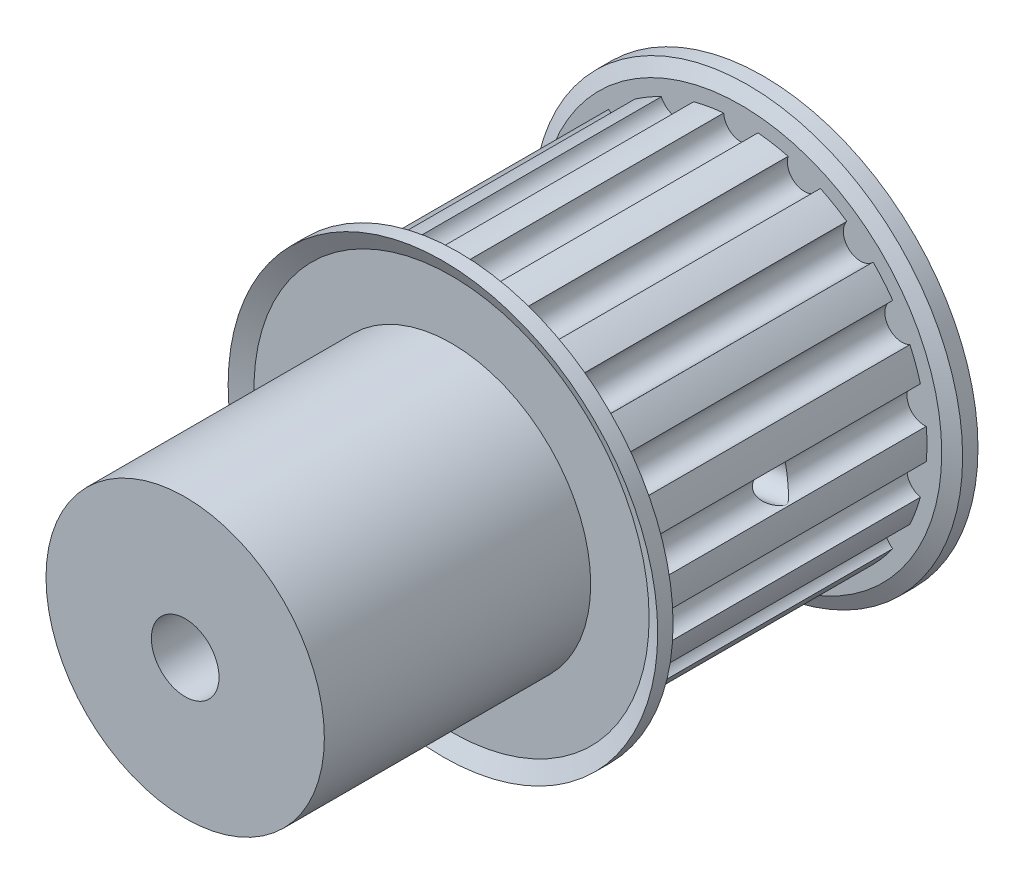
from build123d import *

# Parameters (mm, degrees)
CIRPATTERN2_COUNT  = 2
CIRPATTERN2_ANGLE  = 100
CUT_EXTRUDE2_START = -20.3708
CUT_EXTRUDE2_DEPTH = 20.3708
CIRPATTERN1_COUNT  = 18
SKETCH7_R          = 2.5
CUT_EXTRUDE3_DEPTH = 49.26249983


with BuildPart() as part:
    # Sketch2 → Base-Revolve (revolve)
    with BuildSketch(Plane(origin=(0, 0, 0), x_dir=(0, 0, -1), z_dir=(1, 0, 0)), mode=Mode.PRIVATE) as base_revolve_sk:
        Polygon((-30.8864, 0), (-30.8864, 10.287), (-11.2014, 10.287), (-11.2014, 14.605), (-11.8364, 15.875), (-10.700477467, 15.875), (-10.1854, 14.844845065), (-10.1854, 13.7541), (10.1854, 13.7541), (10.1854, 14.844845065), (10.700477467, 15.875), (11.8364, 15.875), (11.2014, 14.605), (11.2014, 10.287), (11.8364, 10.287), (11.8364, 0), align=None)
    revolve(base_revolve_sk.sketch.rotate(Axis((0, 0, 32.021548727), (0, 0, -1)), 90), axis=Axis((0, 0, 32.021548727), (0, 0, -1)))

    # Sketch5 → M3x0.5 Tapped Hole1 (revolve, cut)
    with BuildSketch(Plane(origin=(0, -13.7541, 0), x_dir=(0, 0, -1), z_dir=(1, 0, 0))):
        Polygon((0, 0), (0, 10.403075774), (1.25, 9.652), (1.25, 0), align=None)
    m3x0_5_tapped_hole1 = revolve(axis=Axis((0, -20.1041, 0), (0, 1, 0)), mode=Mode.SUBTRACT)

    # CirPattern2: M3x0.5 Tapped Hole1 ×2 about axis
    cirpattern2_axis = Axis((0, 0, 30.8864), (0, 0, 1))
    for i in range(1, CIRPATTERN2_COUNT):
        add(m3x0_5_tapped_hole1.rotate(cirpattern2_axis, i * CIRPATTERN2_ANGLE / (CIRPATTERN2_COUNT - 1)), mode=Mode.SUBTRACT)

    # Sketch4 → Cut-Extrude2 (cut)
    with BuildSketch(Plane.XY.offset(10.1854).offset(CUT_EXTRUDE2_START)):
        with BuildLine():
            ThreePointArc((-1.268645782, 13.695466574), (0, 12.4841), (1.268645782, 13.695466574))
            ThreePointArc((1.268645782, 13.695466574), (0, 13.7541), (-1.268645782, 13.695466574))
        make_face()
    cut_extrude2 = extrude(amount=CUT_EXTRUDE2_DEPTH, mode=Mode.SUBTRACT)

    # CirPattern1: Cut-Extrude2 ×18 about axis
    cirpattern1_axis = Axis((0, 0, 0), (0, 0, 1))
    for i in range(1, CIRPATTERN1_COUNT):
        add(cut_extrude2.rotate(cirpattern1_axis, i * 360 / CIRPATTERN1_COUNT), mode=Mode.SUBTRACT)

    # Sketch7 → Cut-Extrude3 (cut, through all)
    with BuildSketch(Plane.XY.offset(30.8864)):
        Circle(SKETCH7_R)
    extrude(amount=-CUT_EXTRUDE3_DEPTH, mode=Mode.SUBTRACT)


solid = part.part
